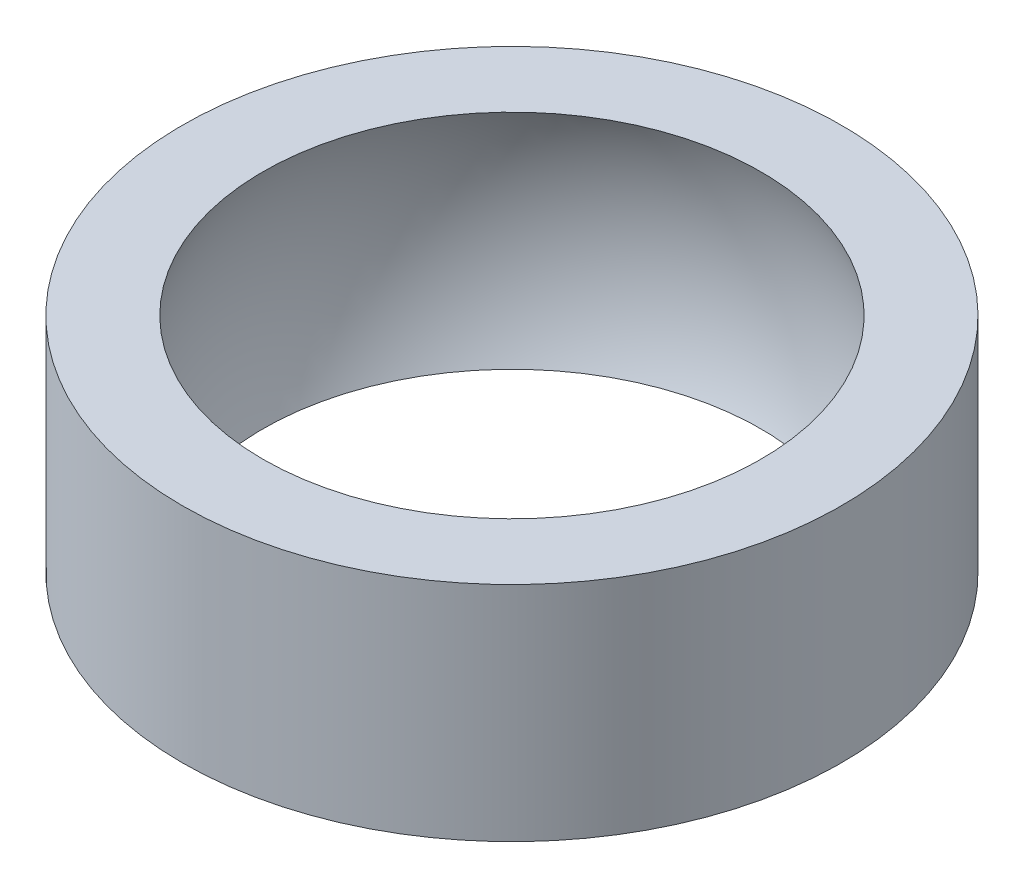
from build123d import *


with BuildPart() as part:
    # Esquisse1 → Base-R_volution (revolve)
    with BuildSketch(Plane.XY, mode=Mode.PRIVATE) as base_r_volution_sk:
        with BuildLine():
            Line((-29.6, -10), (-22.366269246, -10))
            ThreePointArc((-22.366269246, -10), (-24.5, 0), (-22.366269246, 10))
            Line((-22.366269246, 10), (-29.6, 10))
            Line((-29.6, 10), (-29.6, -10))
        make_face()
    revolve(base_r_volution_sk.sketch.rotate(Axis((0, 16.925053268, 0), (0, -1, 0)), 270), axis=Axis((0, 16.925053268, 0), (0, -1, 0)))


solid = part.part
